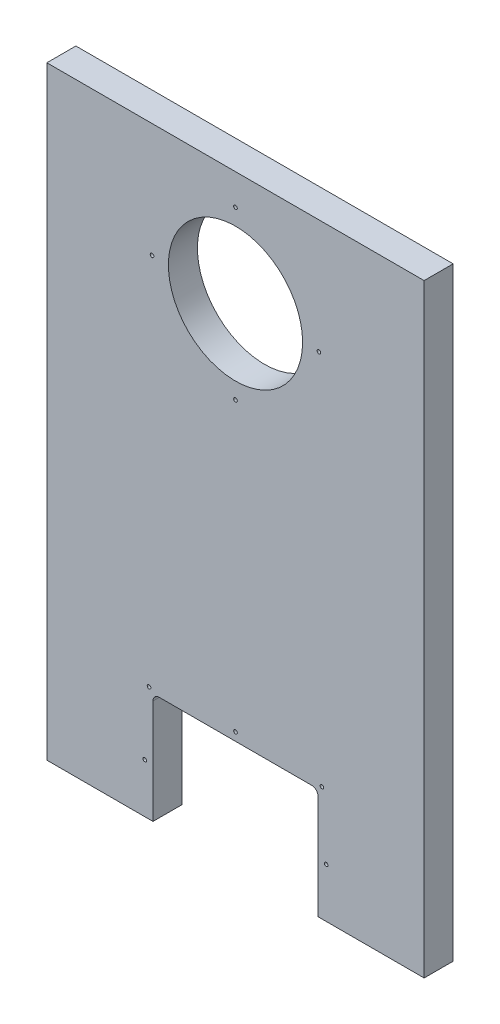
ISO-10303-21;
HEADER;
FILE_DESCRIPTION(('STEP AP214'),'2;1');
FILE_NAME('part.step','',(''),(''),'','','');
FILE_SCHEMA(('AUTOMOTIVE_DESIGN { 1 0 10303 214 1 1 1 1 }'));
ENDSEC;
DATA;
#1=APPLICATION_CONTEXT('core data for automotive mechanical design processes');
#2=APPLICATION_PROTOCOL_DEFINITION('international standard','automotive_design',2000,#1);
#3=PRODUCT_CONTEXT('',#1,'mechanical');
#4=PRODUCT('Part','Part','',(#3));
#5=PRODUCT_RELATED_PRODUCT_CATEGORY('part','',(#4));
#6=PRODUCT_DEFINITION_FORMATION('','',#4);
#7=PRODUCT_DEFINITION_CONTEXT('part definition',#1,'design');
#8=PRODUCT_DEFINITION('design','',#6,#7);
#9=PRODUCT_DEFINITION_SHAPE('','',#8);
#10=(LENGTH_UNIT() NAMED_UNIT(*) SI_UNIT(.MILLI.,.METRE.));
#11=(NAMED_UNIT(*) PLANE_ANGLE_UNIT() SI_UNIT($,.RADIAN.));
#12=(NAMED_UNIT(*) SI_UNIT($,.STERADIAN.) SOLID_ANGLE_UNIT());
#13=UNCERTAINTY_MEASURE_WITH_UNIT(LENGTH_MEASURE(1.E-05),#10,'distance_accuracy_value','');
#14=(GEOMETRIC_REPRESENTATION_CONTEXT(3) GLOBAL_UNCERTAINTY_ASSIGNED_CONTEXT((#13)) GLOBAL_UNIT_ASSIGNED_CONTEXT((#10,
#11,#12)) REPRESENTATION_CONTEXT('',''));
#15=CARTESIAN_POINT('',(0.,0.,0.));
#16=DIRECTION('',(0.,0.,1.));
#17=DIRECTION('',(1.,0.,0.));
#18=AXIS2_PLACEMENT_3D('',#15,#16,#17);
#19=CARTESIAN_POINT('',(0.,-333.,16.));
#20=DIRECTION('',(0.,1.,0.));
#21=DIRECTION('',(0.,0.,1.));
#22=AXIS2_PLACEMENT_3D('',#19,#20,#21);
#23=PLANE('',#22);
#24=DIRECTION('',(1.,0.,0.));
#25=VECTOR('',#24,1.);
#26=CARTESIAN_POINT('',(0.,-333.,0.));
#27=LINE('',#26,#25);
#28=CARTESIAN_POINT('',(0.,-333.,0.));
#29=VERTEX_POINT('',#28);
#30=CARTESIAN_POINT('',(58.5,-333.,0.));
#31=VERTEX_POINT('',#30);
#32=EDGE_CURVE('E134',#29,#31,#27,.T.);
#33=ORIENTED_EDGE('',*,*,#32,.T.);
#34=DIRECTION('',(0.,0.,1.));
#35=VECTOR('',#34,1.);
#36=CARTESIAN_POINT('',(58.5,-333.,0.));
#37=LINE('',#36,#35);
#38=CARTESIAN_POINT('',(58.5,-333.,16.));
#39=VERTEX_POINT('',#38);
#40=EDGE_CURVE('E119',#31,#39,#37,.T.);
#41=ORIENTED_EDGE('',*,*,#40,.T.);
#42=DIRECTION('',(1.,0.,0.));
#43=VECTOR('',#42,1.);
#44=CARTESIAN_POINT('',(0.,-333.,16.));
#45=LINE('',#44,#43);
#46=CARTESIAN_POINT('',(0.,-333.,16.));
#47=VERTEX_POINT('',#46);
#48=EDGE_CURVE('E85',#47,#39,#45,.T.);
#49=ORIENTED_EDGE('',*,*,#48,.F.);
#50=DIRECTION('',(0.,0.,-1.));
#51=VECTOR('',#50,1.);
#52=CARTESIAN_POINT('',(0.,-333.,16.));
#53=LINE('',#52,#51);
#54=EDGE_CURVE('E11',#47,#29,#53,.T.);
#55=ORIENTED_EDGE('',*,*,#54,.T.);
#56=EDGE_LOOP('',(#33,#41,#49,#55));
#57=FACE_BOUND('',#56,.T.);
#58=ADVANCED_FACE('F33',(#57),#23,.F.);
#59=CARTESIAN_POINT('',(0.,-333.,16.));
#60=DIRECTION('',(0.,0.,1.));
#61=DIRECTION('',(1.,0.,0.));
#62=AXIS2_PLACEMENT_3D('',#59,#60,#61);
#63=PLANE('',#62);
#64=CARTESIAN_POINT('',(154.,-305.754268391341,16.));
#65=DIRECTION('',(0.,0.,1.));
#66=DIRECTION('',(1.,0.,0.));
#67=AXIS2_PLACEMENT_3D('',#64,#65,#66);
#68=CIRCLE('',#67,0.999999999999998);
#69=CARTESIAN_POINT('',(155.,-305.754268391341,16.));
#70=VERTEX_POINT('',#69);
#71=EDGE_CURVE('E452',#70,#70,#68,.T.);
#72=ORIENTED_EDGE('',*,*,#71,.F.);
#73=EDGE_LOOP('',(#72));
#74=FACE_BOUND('',#73,.T.);
#75=CARTESIAN_POINT('',(151.656854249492,-269.843145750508,16.));
#76=DIRECTION('',(0.,0.,1.));
#77=DIRECTION('',(1.,0.,0.));
#78=AXIS2_PLACEMENT_3D('',#75,#76,#77);
#79=CIRCLE('',#78,0.999999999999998);
#80=CARTESIAN_POINT('',(152.656854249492,-269.843145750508,16.));
#81=VERTEX_POINT('',#80);
#82=EDGE_CURVE('E454',#81,#81,#79,.T.);
#83=ORIENTED_EDGE('',*,*,#82,.F.);
#84=EDGE_LOOP('',(#83));
#85=FACE_BOUND('',#84,.T.);
#86=CARTESIAN_POINT('',(104.,-267.5,16.));
#87=DIRECTION('',(0.,0.,1.));
#88=DIRECTION('',(1.,0.,0.));
#89=AXIS2_PLACEMENT_3D('',#86,#87,#88);
#90=CIRCLE('',#89,0.999999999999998);
#91=CARTESIAN_POINT('',(105.,-267.5,16.));
#92=VERTEX_POINT('',#91);
#93=EDGE_CURVE('E460',#92,#92,#90,.T.);
#94=ORIENTED_EDGE('',*,*,#93,.F.);
#95=EDGE_LOOP('',(#94));
#96=FACE_BOUND('',#95,.T.);
#97=CARTESIAN_POINT('',(56.3431457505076,-269.843145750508,16.));
#98=DIRECTION('',(0.,0.,1.));
#99=DIRECTION('',(1.,0.,0.));
#100=AXIS2_PLACEMENT_3D('',#97,#98,#99);
#101=CIRCLE('',#100,0.999999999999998);
#102=CARTESIAN_POINT('',(57.3431457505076,-269.843145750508,16.));
#103=VERTEX_POINT('',#102);
#104=EDGE_CURVE('E466',#103,#103,#101,.T.);
#105=ORIENTED_EDGE('',*,*,#104,.F.);
#106=EDGE_LOOP('',(#105));
#107=FACE_BOUND('',#106,.T.);
#108=CARTESIAN_POINT('',(54.,-305.754268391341,16.));
#109=DIRECTION('',(0.,0.,1.));
#110=DIRECTION('',(1.,0.,0.));
#111=AXIS2_PLACEMENT_3D('',#108,#109,#110);
#112=CIRCLE('',#111,0.999999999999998);
#113=CARTESIAN_POINT('',(55.,-305.754268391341,16.));
#114=VERTEX_POINT('',#113);
#115=EDGE_CURVE('E197',#114,#114,#112,.T.);
#116=ORIENTED_EDGE('',*,*,#115,.F.);
#117=EDGE_LOOP('',(#116));
#118=FACE_BOUND('',#117,.T.);
#119=DIRECTION('',(0.,-1.,0.));
#120=VECTOR('',#119,1.);
#121=CARTESIAN_POINT('',(58.5,-333.,16.));
#122=LINE('',#121,#120);
#123=CARTESIAN_POINT('',(58.5,-275.5,16.));
#124=VERTEX_POINT('',#123);
#125=EDGE_CURVE('E125',#124,#39,#122,.T.);
#126=ORIENTED_EDGE('',*,*,#125,.F.);
#127=CARTESIAN_POINT('',(62.,-275.5,16.));
#128=DIRECTION('',(0.,0.,1.));
#129=DIRECTION('',(-1.,0.,0.));
#130=AXIS2_PLACEMENT_3D('',#127,#128,#129);
#131=CIRCLE('',#130,3.5);
#132=CARTESIAN_POINT('',(62.,-272.,16.));
#133=VERTEX_POINT('',#132);
#134=EDGE_CURVE('E137',#133,#124,#131,.T.);
#135=ORIENTED_EDGE('',*,*,#134,.F.);
#136=DIRECTION('',(-1.,0.,0.));
#137=VECTOR('',#136,1.);
#138=CARTESIAN_POINT('',(62.,-272.,16.));
#139=LINE('',#138,#137);
#140=CARTESIAN_POINT('',(146.,-272.,16.));
#141=VERTEX_POINT('',#140);
#142=EDGE_CURVE('E204',#141,#133,#139,.T.);
#143=ORIENTED_EDGE('',*,*,#142,.F.);
#144=CARTESIAN_POINT('',(146.,-275.5,16.));
#145=DIRECTION('',(0.,0.,1.));
#146=DIRECTION('',(1.,0.,0.));
#147=AXIS2_PLACEMENT_3D('',#144,#145,#146);
#148=CIRCLE('',#147,3.5);
#149=CARTESIAN_POINT('',(149.5,-275.5,16.));
#150=VERTEX_POINT('',#149);
#151=EDGE_CURVE('E194',#150,#141,#148,.T.);
#152=ORIENTED_EDGE('',*,*,#151,.F.);
#153=DIRECTION('',(0.,1.,0.));
#154=VECTOR('',#153,1.);
#155=CARTESIAN_POINT('',(149.5,-333.,16.));
#156=LINE('',#155,#154);
#157=CARTESIAN_POINT('',(149.5,-333.,16.));
#158=VERTEX_POINT('',#157);
#159=EDGE_CURVE('E190',#158,#150,#156,.T.);
#160=ORIENTED_EDGE('',*,*,#159,.F.);
#161=CARTESIAN_POINT('',(208.,-333.,16.));
#162=VERTEX_POINT('',#161);
#163=EDGE_CURVE('E180',#158,#162,#45,.T.);
#164=ORIENTED_EDGE('',*,*,#163,.T.);
#165=DIRECTION('',(0.,1.,0.));
#166=VECTOR('',#165,1.);
#167=CARTESIAN_POINT('',(208.,0.,16.));
#168=LINE('',#167,#166);
#169=CARTESIAN_POINT('',(208.,0.,16.));
#170=VERTEX_POINT('',#169);
#171=EDGE_CURVE('E161',#162,#170,#168,.T.);
#172=ORIENTED_EDGE('',*,*,#171,.T.);
#173=DIRECTION('',(-1.,0.,0.));
#174=VECTOR('',#173,1.);
#175=CARTESIAN_POINT('',(0.,0.,16.));
#176=LINE('',#175,#174);
#177=CARTESIAN_POINT('',(0.,0.,16.));
#178=VERTEX_POINT('',#177);
#179=EDGE_CURVE('E57',#170,#178,#176,.T.);
#180=ORIENTED_EDGE('',*,*,#179,.T.);
#181=DIRECTION('',(0.,-1.,0.));
#182=VECTOR('',#181,1.);
#183=CARTESIAN_POINT('',(0.,0.,16.));
#184=LINE('',#183,#182);
#185=EDGE_CURVE('E150',#178,#47,#184,.T.);
#186=ORIENTED_EDGE('',*,*,#185,.T.);
#187=ORIENTED_EDGE('',*,*,#48,.T.);
#188=EDGE_LOOP('',(#126,#135,#143,#152,#160,#164,#172,#180,#186,#187));
#189=FACE_BOUND('',#188,.T.);
#190=CARTESIAN_POINT('',(150.,-63.0000000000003,16.));
#191=DIRECTION('',(0.,0.,1.));
#192=DIRECTION('',(1.,0.,0.));
#193=AXIS2_PLACEMENT_3D('',#190,#191,#192);
#194=CIRCLE('',#193,0.999999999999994);
#195=CARTESIAN_POINT('',(151.,-63.0000000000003,16.));
#196=VERTEX_POINT('',#195);
#197=EDGE_CURVE('E224',#196,#196,#194,.T.);
#198=ORIENTED_EDGE('',*,*,#197,.F.);
#199=EDGE_LOOP('',(#198));
#200=FACE_BOUND('',#199,.T.);
#201=CARTESIAN_POINT('',(58.,-63.,16.));
#202=DIRECTION('',(0.,0.,1.));
#203=DIRECTION('',(1.,0.,0.));
#204=AXIS2_PLACEMENT_3D('',#201,#202,#203);
#205=CIRCLE('',#204,0.999999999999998);
#206=CARTESIAN_POINT('',(59.,-63.,16.));
#207=VERTEX_POINT('',#206);
#208=EDGE_CURVE('E173',#207,#207,#205,.T.);
#209=ORIENTED_EDGE('',*,*,#208,.F.);
#210=EDGE_LOOP('',(#209));
#211=FACE_BOUND('',#210,.T.);
#212=CARTESIAN_POINT('',(104.,-63.,16.));
#213=DIRECTION('',(0.,0.,1.));
#214=DIRECTION('',(1.,0.,0.));
#215=AXIS2_PLACEMENT_3D('',#212,#213,#214);
#216=CIRCLE('',#215,37.);
#217=CARTESIAN_POINT('',(141.,-63.,16.));
#218=VERTEX_POINT('',#217);
#219=EDGE_CURVE('E166',#218,#218,#216,.T.);
#220=ORIENTED_EDGE('',*,*,#219,.F.);
#221=EDGE_LOOP('',(#220));
#222=FACE_BOUND('',#221,.T.);
#223=CARTESIAN_POINT('',(104.,-17.,16.));
#224=DIRECTION('',(0.,0.,1.));
#225=DIRECTION('',(1.,0.,0.));
#226=AXIS2_PLACEMENT_3D('',#223,#224,#225);
#227=CIRCLE('',#226,0.999999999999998);
#228=CARTESIAN_POINT('',(105.,-17.,16.));
#229=VERTEX_POINT('',#228);
#230=EDGE_CURVE('E230',#229,#229,#227,.T.);
#231=ORIENTED_EDGE('',*,*,#230,.F.);
#232=EDGE_LOOP('',(#231));
#233=FACE_BOUND('',#232,.T.);
#234=CARTESIAN_POINT('',(104.,-109.,16.));
#235=DIRECTION('',(0.,0.,1.));
#236=DIRECTION('',(1.,0.,0.));
#237=AXIS2_PLACEMENT_3D('',#234,#235,#236);
#238=CIRCLE('',#237,0.999999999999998);
#239=CARTESIAN_POINT('',(105.,-109.,16.));
#240=VERTEX_POINT('',#239);
#241=EDGE_CURVE('E218',#240,#240,#238,.T.);
#242=ORIENTED_EDGE('',*,*,#241,.F.);
#243=EDGE_LOOP('',(#242));
#244=FACE_BOUND('',#243,.T.);
#245=ADVANCED_FACE('F182',(#74,#85,#96,#107,#118,#189,#200,#211,#222,#233,#244),#63,.T.);
#246=CARTESIAN_POINT('',(0.,-333.,0.));
#247=DIRECTION('',(0.,0.,1.));
#248=DIRECTION('',(1.,0.,0.));
#249=AXIS2_PLACEMENT_3D('',#246,#247,#248);
#250=PLANE('',#249);
#251=CARTESIAN_POINT('',(154.,-305.754268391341,0.));
#252=DIRECTION('',(0.,0.,1.));
#253=DIRECTION('',(1.,0.,0.));
#254=AXIS2_PLACEMENT_3D('',#251,#252,#253);
#255=CIRCLE('',#254,0.999999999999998);
#256=CARTESIAN_POINT('',(155.,-305.754268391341,0.));
#257=VERTEX_POINT('',#256);
#258=EDGE_CURVE('E449',#257,#257,#255,.T.);
#259=ORIENTED_EDGE('',*,*,#258,.T.);
#260=EDGE_LOOP('',(#259));
#261=FACE_BOUND('',#260,.T.);
#262=CARTESIAN_POINT('',(151.656854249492,-269.843145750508,0.));
#263=DIRECTION('',(0.,0.,1.));
#264=DIRECTION('',(1.,0.,0.));
#265=AXIS2_PLACEMENT_3D('',#262,#263,#264);
#266=CIRCLE('',#265,0.999999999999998);
#267=CARTESIAN_POINT('',(152.656854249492,-269.843145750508,0.));
#268=VERTEX_POINT('',#267);
#269=EDGE_CURVE('E457',#268,#268,#266,.T.);
#270=ORIENTED_EDGE('',*,*,#269,.T.);
#271=EDGE_LOOP('',(#270));
#272=FACE_BOUND('',#271,.T.);
#273=CARTESIAN_POINT('',(104.,-267.5,0.));
#274=DIRECTION('',(0.,0.,1.));
#275=DIRECTION('',(1.,0.,0.));
#276=AXIS2_PLACEMENT_3D('',#273,#274,#275);
#277=CIRCLE('',#276,0.999999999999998);
#278=CARTESIAN_POINT('',(105.,-267.5,0.));
#279=VERTEX_POINT('',#278);
#280=EDGE_CURVE('E463',#279,#279,#277,.T.);
#281=ORIENTED_EDGE('',*,*,#280,.T.);
#282=EDGE_LOOP('',(#281));
#283=FACE_BOUND('',#282,.T.);
#284=CARTESIAN_POINT('',(56.3431457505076,-269.843145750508,0.));
#285=DIRECTION('',(0.,0.,1.));
#286=DIRECTION('',(1.,0.,0.));
#287=AXIS2_PLACEMENT_3D('',#284,#285,#286);
#288=CIRCLE('',#287,0.999999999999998);
#289=CARTESIAN_POINT('',(57.3431457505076,-269.843145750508,0.));
#290=VERTEX_POINT('',#289);
#291=EDGE_CURVE('E469',#290,#290,#288,.T.);
#292=ORIENTED_EDGE('',*,*,#291,.T.);
#293=EDGE_LOOP('',(#292));
#294=FACE_BOUND('',#293,.T.);
#295=CARTESIAN_POINT('',(54.,-305.754268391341,0.));
#296=DIRECTION('',(0.,0.,1.));
#297=DIRECTION('',(1.,0.,0.));
#298=AXIS2_PLACEMENT_3D('',#295,#296,#297);
#299=CIRCLE('',#298,0.999999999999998);
#300=CARTESIAN_POINT('',(55.,-305.754268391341,0.));
#301=VERTEX_POINT('',#300);
#302=EDGE_CURVE('E191',#301,#301,#299,.T.);
#303=ORIENTED_EDGE('',*,*,#302,.T.);
#304=EDGE_LOOP('',(#303));
#305=FACE_BOUND('',#304,.T.);
#306=CARTESIAN_POINT('',(150.,-63.0000000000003,0.));
#307=DIRECTION('',(0.,0.,1.));
#308=DIRECTION('',(1.,0.,0.));
#309=AXIS2_PLACEMENT_3D('',#306,#307,#308);
#310=CIRCLE('',#309,0.999999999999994);
#311=CARTESIAN_POINT('',(151.,-63.0000000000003,0.));
#312=VERTEX_POINT('',#311);
#313=EDGE_CURVE('E221',#312,#312,#310,.T.);
#314=ORIENTED_EDGE('',*,*,#313,.T.);
#315=EDGE_LOOP('',(#314));
#316=FACE_BOUND('',#315,.T.);
#317=CARTESIAN_POINT('',(58.,-63.,0.));
#318=DIRECTION('',(0.,0.,1.));
#319=DIRECTION('',(1.,0.,0.));
#320=AXIS2_PLACEMENT_3D('',#317,#318,#319);
#321=CIRCLE('',#320,0.999999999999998);
#322=CARTESIAN_POINT('',(59.,-63.,0.));
#323=VERTEX_POINT('',#322);
#324=EDGE_CURVE('E176',#323,#323,#321,.T.);
#325=ORIENTED_EDGE('',*,*,#324,.T.);
#326=EDGE_LOOP('',(#325));
#327=FACE_BOUND('',#326,.T.);
#328=CARTESIAN_POINT('',(62.,-275.5,0.));
#329=DIRECTION('',(0.,0.,1.));
#330=DIRECTION('',(-1.,0.,0.));
#331=AXIS2_PLACEMENT_3D('',#328,#329,#330);
#332=CIRCLE('',#331,3.5);
#333=CARTESIAN_POINT('',(62.,-272.,0.));
#334=VERTEX_POINT('',#333);
#335=CARTESIAN_POINT('',(58.5,-275.5,0.));
#336=VERTEX_POINT('',#335);
#337=EDGE_CURVE('E128',#334,#336,#332,.T.);
#338=ORIENTED_EDGE('',*,*,#337,.T.);
#339=DIRECTION('',(0.,-1.,0.));
#340=VECTOR('',#339,1.);
#341=CARTESIAN_POINT('',(58.5,-333.,0.));
#342=LINE('',#341,#340);
#343=EDGE_CURVE('E122',#336,#31,#342,.T.);
#344=ORIENTED_EDGE('',*,*,#343,.T.);
#345=ORIENTED_EDGE('',*,*,#32,.F.);
#346=DIRECTION('',(0.,-1.,0.));
#347=VECTOR('',#346,1.);
#348=CARTESIAN_POINT('',(0.,0.,0.));
#349=LINE('',#348,#347);
#350=CARTESIAN_POINT('',(0.,0.,0.));
#351=VERTEX_POINT('',#350);
#352=EDGE_CURVE('E145',#351,#29,#349,.T.);
#353=ORIENTED_EDGE('',*,*,#352,.F.);
#354=DIRECTION('',(-1.,0.,0.));
#355=VECTOR('',#354,1.);
#356=CARTESIAN_POINT('',(0.,0.,0.));
#357=LINE('',#356,#355);
#358=CARTESIAN_POINT('',(208.,0.,0.));
#359=VERTEX_POINT('',#358);
#360=EDGE_CURVE('E78',#359,#351,#357,.T.);
#361=ORIENTED_EDGE('',*,*,#360,.F.);
#362=DIRECTION('',(0.,1.,0.));
#363=VECTOR('',#362,1.);
#364=CARTESIAN_POINT('',(208.,0.,0.));
#365=LINE('',#364,#363);
#366=CARTESIAN_POINT('',(208.,-333.,0.));
#367=VERTEX_POINT('',#366);
#368=EDGE_CURVE('E141',#367,#359,#365,.T.);
#369=ORIENTED_EDGE('',*,*,#368,.F.);
#370=CARTESIAN_POINT('',(149.5,-333.,0.));
#371=VERTEX_POINT('',#370);
#372=EDGE_CURVE('E142',#371,#367,#27,.T.);
#373=ORIENTED_EDGE('',*,*,#372,.F.);
#374=DIRECTION('',(0.,1.,0.));
#375=VECTOR('',#374,1.);
#376=CARTESIAN_POINT('',(149.5,-333.,0.));
#377=LINE('',#376,#375);
#378=CARTESIAN_POINT('',(149.5,-275.5,0.));
#379=VERTEX_POINT('',#378);
#380=EDGE_CURVE('E48',#371,#379,#377,.T.);
#381=ORIENTED_EDGE('',*,*,#380,.T.);
#382=CARTESIAN_POINT('',(146.,-275.5,0.));
#383=DIRECTION('',(0.,0.,1.));
#384=DIRECTION('',(1.,0.,0.));
#385=AXIS2_PLACEMENT_3D('',#382,#383,#384);
#386=CIRCLE('',#385,3.5);
#387=CARTESIAN_POINT('',(146.,-272.,0.));
#388=VERTEX_POINT('',#387);
#389=EDGE_CURVE('E274',#379,#388,#386,.T.);
#390=ORIENTED_EDGE('',*,*,#389,.T.);
#391=DIRECTION('',(-1.,0.,0.));
#392=VECTOR('',#391,1.);
#393=CARTESIAN_POINT('',(62.,-272.,0.));
#394=LINE('',#393,#392);
#395=EDGE_CURVE('E275',#388,#334,#394,.T.);
#396=ORIENTED_EDGE('',*,*,#395,.T.);
#397=EDGE_LOOP('',(#338,#344,#345,#353,#361,#369,#373,#381,#390,#396));
#398=FACE_BOUND('',#397,.T.);
#399=CARTESIAN_POINT('',(104.,-63.,0.));
#400=DIRECTION('',(0.,0.,1.));
#401=DIRECTION('',(1.,0.,0.));
#402=AXIS2_PLACEMENT_3D('',#399,#400,#401);
#403=CIRCLE('',#402,37.);
#404=CARTESIAN_POINT('',(141.,-63.,0.));
#405=VERTEX_POINT('',#404);
#406=EDGE_CURVE('E168',#405,#405,#403,.T.);
#407=ORIENTED_EDGE('',*,*,#406,.T.);
#408=EDGE_LOOP('',(#407));
#409=FACE_BOUND('',#408,.T.);
#410=CARTESIAN_POINT('',(104.,-17.,0.));
#411=DIRECTION('',(0.,0.,1.));
#412=DIRECTION('',(1.,0.,0.));
#413=AXIS2_PLACEMENT_3D('',#410,#411,#412);
#414=CIRCLE('',#413,0.999999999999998);
#415=CARTESIAN_POINT('',(105.,-17.,0.));
#416=VERTEX_POINT('',#415);
#417=EDGE_CURVE('E227',#416,#416,#414,.T.);
#418=ORIENTED_EDGE('',*,*,#417,.T.);
#419=EDGE_LOOP('',(#418));
#420=FACE_BOUND('',#419,.T.);
#421=CARTESIAN_POINT('',(104.,-109.,0.));
#422=DIRECTION('',(0.,0.,1.));
#423=DIRECTION('',(1.,0.,0.));
#424=AXIS2_PLACEMENT_3D('',#421,#422,#423);
#425=CIRCLE('',#424,0.999999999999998);
#426=CARTESIAN_POINT('',(105.,-109.,0.));
#427=VERTEX_POINT('',#426);
#428=EDGE_CURVE('E210',#427,#427,#425,.T.);
#429=ORIENTED_EDGE('',*,*,#428,.T.);
#430=EDGE_LOOP('',(#429));
#431=FACE_BOUND('',#430,.T.);
#432=ADVANCED_FACE('F131',(#261,#272,#283,#294,#305,#316,#327,#398,#409,#420,#431),#250,.F.);
#433=CARTESIAN_POINT('',(0.,0.,16.));
#434=DIRECTION('',(1.,0.,0.));
#435=DIRECTION('',(0.,1.,0.));
#436=AXIS2_PLACEMENT_3D('',#433,#434,#435);
#437=PLANE('',#436);
#438=ORIENTED_EDGE('',*,*,#352,.T.);
#439=ORIENTED_EDGE('',*,*,#54,.F.);
#440=ORIENTED_EDGE('',*,*,#185,.F.);
#441=DIRECTION('',(0.,0.,-1.));
#442=VECTOR('',#441,1.);
#443=CARTESIAN_POINT('',(0.,0.,16.));
#444=LINE('',#443,#442);
#445=EDGE_CURVE('E151',#178,#351,#444,.T.);
#446=ORIENTED_EDGE('',*,*,#445,.T.);
#447=EDGE_LOOP('',(#438,#439,#440,#446));
#448=FACE_BOUND('',#447,.T.);
#449=ADVANCED_FACE('F35',(#448),#437,.F.);
#450=ORIENTED_EDGE('',*,*,#163,.F.);
#451=DIRECTION('',(0.,0.,1.));
#452=VECTOR('',#451,1.);
#453=CARTESIAN_POINT('',(149.5,-333.,0.));
#454=LINE('',#453,#452);
#455=EDGE_CURVE('E127',#371,#158,#454,.T.);
#456=ORIENTED_EDGE('',*,*,#455,.F.);
#457=ORIENTED_EDGE('',*,*,#372,.T.);
#458=DIRECTION('',(0.,0.,-1.));
#459=VECTOR('',#458,1.);
#460=CARTESIAN_POINT('',(208.,-333.,16.));
#461=LINE('',#460,#459);
#462=EDGE_CURVE('E41',#162,#367,#461,.T.);
#463=ORIENTED_EDGE('',*,*,#462,.F.);
#464=EDGE_LOOP('',(#450,#456,#457,#463));
#465=FACE_BOUND('',#464,.T.);
#466=ADVANCED_FACE('F255',(#465),#23,.F.);
#467=CARTESIAN_POINT('',(208.,0.,16.));
#468=DIRECTION('',(-1.,0.,0.));
#469=DIRECTION('',(0.,-1.,0.));
#470=AXIS2_PLACEMENT_3D('',#467,#468,#469);
#471=PLANE('',#470);
#472=ORIENTED_EDGE('',*,*,#368,.T.);
#473=DIRECTION('',(0.,0.,-1.));
#474=VECTOR('',#473,1.);
#475=CARTESIAN_POINT('',(208.,0.,16.));
#476=LINE('',#475,#474);
#477=EDGE_CURVE('E153',#170,#359,#476,.T.);
#478=ORIENTED_EDGE('',*,*,#477,.F.);
#479=ORIENTED_EDGE('',*,*,#171,.F.);
#480=ORIENTED_EDGE('',*,*,#462,.T.);
#481=EDGE_LOOP('',(#472,#478,#479,#480));
#482=FACE_BOUND('',#481,.T.);
#483=ADVANCED_FACE('F159',(#482),#471,.F.);
#484=CARTESIAN_POINT('',(0.,0.,16.));
#485=DIRECTION('',(0.,-1.,0.));
#486=DIRECTION('',(0.,0.,-1.));
#487=AXIS2_PLACEMENT_3D('',#484,#485,#486);
#488=PLANE('',#487);
#489=ORIENTED_EDGE('',*,*,#360,.T.);
#490=ORIENTED_EDGE('',*,*,#445,.F.);
#491=ORIENTED_EDGE('',*,*,#179,.F.);
#492=ORIENTED_EDGE('',*,*,#477,.T.);
#493=EDGE_LOOP('',(#489,#490,#491,#492));
#494=FACE_BOUND('',#493,.T.);
#495=ADVANCED_FACE('F185',(#494),#488,.F.);
#496=CARTESIAN_POINT('',(104.,-63.,16.));
#497=DIRECTION('',(0.,0.,-1.));
#498=DIRECTION('',(-1.,0.,0.));
#499=AXIS2_PLACEMENT_3D('',#496,#497,#498);
#500=CYLINDRICAL_SURFACE('',#499,37.);
#501=ORIENTED_EDGE('',*,*,#219,.T.);
#502=EDGE_LOOP('',(#501));
#503=FACE_BOUND('',#502,.T.);
#504=ORIENTED_EDGE('',*,*,#406,.F.);
#505=EDGE_LOOP('',(#504));
#506=FACE_BOUND('',#505,.T.);
#507=ADVANCED_FACE('F244',(#503,#506),#500,.F.);
#508=CARTESIAN_POINT('',(58.,-63.,16.));
#509=DIRECTION('',(0.,0.,-1.));
#510=DIRECTION('',(-1.,0.,0.));
#511=AXIS2_PLACEMENT_3D('',#508,#509,#510);
#512=CYLINDRICAL_SURFACE('',#511,0.999999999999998);
#513=ORIENTED_EDGE('',*,*,#208,.T.);
#514=EDGE_LOOP('',(#513));
#515=FACE_BOUND('',#514,.T.);
#516=ORIENTED_EDGE('',*,*,#324,.F.);
#517=EDGE_LOOP('',(#516));
#518=FACE_BOUND('',#517,.T.);
#519=ADVANCED_FACE('F241',(#515,#518),#512,.F.);
#520=CARTESIAN_POINT('',(104.,-17.,16.));
#521=DIRECTION('',(0.,0.,-1.));
#522=DIRECTION('',(-1.,0.,0.));
#523=AXIS2_PLACEMENT_3D('',#520,#521,#522);
#524=CYLINDRICAL_SURFACE('',#523,0.999999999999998);
#525=ORIENTED_EDGE('',*,*,#230,.T.);
#526=EDGE_LOOP('',(#525));
#527=FACE_BOUND('',#526,.T.);
#528=ORIENTED_EDGE('',*,*,#417,.F.);
#529=EDGE_LOOP('',(#528));
#530=FACE_BOUND('',#529,.T.);
#531=ADVANCED_FACE('F243',(#527,#530),#524,.F.);
#532=CARTESIAN_POINT('',(150.,-63.0000000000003,16.));
#533=DIRECTION('',(0.,0.,-1.));
#534=DIRECTION('',(-1.,0.,0.));
#535=AXIS2_PLACEMENT_3D('',#532,#533,#534);
#536=CYLINDRICAL_SURFACE('',#535,0.999999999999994);
#537=ORIENTED_EDGE('',*,*,#197,.T.);
#538=EDGE_LOOP('',(#537));
#539=FACE_BOUND('',#538,.T.);
#540=ORIENTED_EDGE('',*,*,#313,.F.);
#541=EDGE_LOOP('',(#540));
#542=FACE_BOUND('',#541,.T.);
#543=ADVANCED_FACE('F250',(#539,#542),#536,.F.);
#544=CARTESIAN_POINT('',(104.,-109.,16.));
#545=DIRECTION('',(0.,0.,-1.));
#546=DIRECTION('',(-1.,0.,0.));
#547=AXIS2_PLACEMENT_3D('',#544,#545,#546);
#548=CYLINDRICAL_SURFACE('',#547,0.999999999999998);
#549=ORIENTED_EDGE('',*,*,#241,.T.);
#550=EDGE_LOOP('',(#549));
#551=FACE_BOUND('',#550,.T.);
#552=ORIENTED_EDGE('',*,*,#428,.F.);
#553=EDGE_LOOP('',(#552));
#554=FACE_BOUND('',#553,.T.);
#555=ADVANCED_FACE('F290',(#551,#554),#548,.F.);
#556=CARTESIAN_POINT('',(58.5,-333.,0.));
#557=DIRECTION('',(-1.,0.,0.));
#558=DIRECTION('',(0.,0.,1.));
#559=AXIS2_PLACEMENT_3D('',#556,#557,#558);
#560=PLANE('',#559);
#561=ORIENTED_EDGE('',*,*,#125,.T.);
#562=ORIENTED_EDGE('',*,*,#40,.F.);
#563=ORIENTED_EDGE('',*,*,#343,.F.);
#564=DIRECTION('',(0.,0.,1.));
#565=VECTOR('',#564,1.);
#566=CARTESIAN_POINT('',(58.5,-275.5,0.));
#567=LINE('',#566,#565);
#568=EDGE_CURVE('E208',#336,#124,#567,.T.);
#569=ORIENTED_EDGE('',*,*,#568,.T.);
#570=EDGE_LOOP('',(#561,#562,#563,#569));
#571=FACE_BOUND('',#570,.T.);
#572=ADVANCED_FACE('F121',(#571),#560,.F.);
#573=CARTESIAN_POINT('',(62.,-275.5,0.));
#574=DIRECTION('',(0.,0.,1.));
#575=DIRECTION('',(1.,0.,0.));
#576=AXIS2_PLACEMENT_3D('',#573,#574,#575);
#577=CYLINDRICAL_SURFACE('',#576,3.5);
#578=ORIENTED_EDGE('',*,*,#134,.T.);
#579=ORIENTED_EDGE('',*,*,#568,.F.);
#580=ORIENTED_EDGE('',*,*,#337,.F.);
#581=DIRECTION('',(0.,0.,1.));
#582=VECTOR('',#581,1.);
#583=CARTESIAN_POINT('',(62.,-272.,0.));
#584=LINE('',#583,#582);
#585=EDGE_CURVE('E211',#334,#133,#584,.T.);
#586=ORIENTED_EDGE('',*,*,#585,.T.);
#587=EDGE_LOOP('',(#578,#579,#580,#586));
#588=FACE_BOUND('',#587,.T.);
#589=ADVANCED_FACE('F282',(#588),#577,.F.);
#590=CARTESIAN_POINT('',(62.,-272.,0.));
#591=DIRECTION('',(0.,1.,0.));
#592=DIRECTION('',(0.,0.,1.));
#593=AXIS2_PLACEMENT_3D('',#590,#591,#592);
#594=PLANE('',#593);
#595=ORIENTED_EDGE('',*,*,#142,.T.);
#596=ORIENTED_EDGE('',*,*,#585,.F.);
#597=ORIENTED_EDGE('',*,*,#395,.F.);
#598=DIRECTION('',(0.,0.,1.));
#599=VECTOR('',#598,1.);
#600=CARTESIAN_POINT('',(146.,-272.,0.));
#601=LINE('',#600,#599);
#602=EDGE_CURVE('E213',#388,#141,#601,.T.);
#603=ORIENTED_EDGE('',*,*,#602,.T.);
#604=EDGE_LOOP('',(#595,#596,#597,#603));
#605=FACE_BOUND('',#604,.T.);
#606=ADVANCED_FACE('F280',(#605),#594,.F.);
#607=CARTESIAN_POINT('',(146.,-275.5,0.));
#608=DIRECTION('',(0.,0.,1.));
#609=DIRECTION('',(1.,0.,0.));
#610=AXIS2_PLACEMENT_3D('',#607,#608,#609);
#611=CYLINDRICAL_SURFACE('',#610,3.5);
#612=ORIENTED_EDGE('',*,*,#151,.T.);
#613=ORIENTED_EDGE('',*,*,#602,.F.);
#614=ORIENTED_EDGE('',*,*,#389,.F.);
#615=DIRECTION('',(0.,0.,1.));
#616=VECTOR('',#615,1.);
#617=CARTESIAN_POINT('',(149.5,-275.5,0.));
#618=LINE('',#617,#616);
#619=EDGE_CURVE('E215',#379,#150,#618,.T.);
#620=ORIENTED_EDGE('',*,*,#619,.T.);
#621=EDGE_LOOP('',(#612,#613,#614,#620));
#622=FACE_BOUND('',#621,.T.);
#623=ADVANCED_FACE('F270',(#622),#611,.F.);
#624=CARTESIAN_POINT('',(149.5,-333.,0.));
#625=DIRECTION('',(1.,0.,0.));
#626=DIRECTION('',(0.,0.,-1.));
#627=AXIS2_PLACEMENT_3D('',#624,#625,#626);
#628=PLANE('',#627);
#629=ORIENTED_EDGE('',*,*,#159,.T.);
#630=ORIENTED_EDGE('',*,*,#619,.F.);
#631=ORIENTED_EDGE('',*,*,#380,.F.);
#632=ORIENTED_EDGE('',*,*,#455,.T.);
#633=EDGE_LOOP('',(#629,#630,#631,#632));
#634=FACE_BOUND('',#633,.T.);
#635=ADVANCED_FACE('F267',(#634),#628,.F.);
#636=CARTESIAN_POINT('',(54.,-305.754268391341,0.));
#637=DIRECTION('',(0.,0.,1.));
#638=DIRECTION('',(1.,0.,0.));
#639=AXIS2_PLACEMENT_3D('',#636,#637,#638);
#640=CYLINDRICAL_SURFACE('',#639,0.999999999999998);
#641=ORIENTED_EDGE('',*,*,#302,.F.);
#642=EDGE_LOOP('',(#641));
#643=FACE_BOUND('',#642,.T.);
#644=ORIENTED_EDGE('',*,*,#115,.T.);
#645=EDGE_LOOP('',(#644));
#646=FACE_BOUND('',#645,.T.);
#647=ADVANCED_FACE('F293',(#643,#646),#640,.F.);
#648=CARTESIAN_POINT('',(56.3431457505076,-269.843145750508,0.));
#649=DIRECTION('',(0.,0.,1.));
#650=DIRECTION('',(1.,0.,0.));
#651=AXIS2_PLACEMENT_3D('',#648,#649,#650);
#652=CYLINDRICAL_SURFACE('',#651,0.999999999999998);
#653=ORIENTED_EDGE('',*,*,#291,.F.);
#654=EDGE_LOOP('',(#653));
#655=FACE_BOUND('',#654,.T.);
#656=ORIENTED_EDGE('',*,*,#104,.T.);
#657=EDGE_LOOP('',(#656));
#658=FACE_BOUND('',#657,.T.);
#659=ADVANCED_FACE('F405',(#655,#658),#652,.F.);
#660=CARTESIAN_POINT('',(104.,-267.5,0.));
#661=DIRECTION('',(0.,0.,1.));
#662=DIRECTION('',(1.,0.,0.));
#663=AXIS2_PLACEMENT_3D('',#660,#661,#662);
#664=CYLINDRICAL_SURFACE('',#663,0.999999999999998);
#665=ORIENTED_EDGE('',*,*,#280,.F.);
#666=EDGE_LOOP('',(#665));
#667=FACE_BOUND('',#666,.T.);
#668=ORIENTED_EDGE('',*,*,#93,.T.);
#669=EDGE_LOOP('',(#668));
#670=FACE_BOUND('',#669,.T.);
#671=ADVANCED_FACE('F414',(#667,#670),#664,.F.);
#672=CARTESIAN_POINT('',(151.656854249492,-269.843145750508,0.));
#673=DIRECTION('',(0.,0.,1.));
#674=DIRECTION('',(1.,0.,0.));
#675=AXIS2_PLACEMENT_3D('',#672,#673,#674);
#676=CYLINDRICAL_SURFACE('',#675,0.999999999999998);
#677=ORIENTED_EDGE('',*,*,#269,.F.);
#678=EDGE_LOOP('',(#677));
#679=FACE_BOUND('',#678,.T.);
#680=ORIENTED_EDGE('',*,*,#82,.T.);
#681=EDGE_LOOP('',(#680));
#682=FACE_BOUND('',#681,.T.);
#683=ADVANCED_FACE('F423',(#679,#682),#676,.F.);
#684=CARTESIAN_POINT('',(154.,-305.754268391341,0.));
#685=DIRECTION('',(0.,0.,1.));
#686=DIRECTION('',(1.,0.,0.));
#687=AXIS2_PLACEMENT_3D('',#684,#685,#686);
#688=CYLINDRICAL_SURFACE('',#687,0.999999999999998);
#689=ORIENTED_EDGE('',*,*,#258,.F.);
#690=EDGE_LOOP('',(#689));
#691=FACE_BOUND('',#690,.T.);
#692=ORIENTED_EDGE('',*,*,#71,.T.);
#693=EDGE_LOOP('',(#692));
#694=FACE_BOUND('',#693,.T.);
#695=ADVANCED_FACE('F433',(#691,#694),#688,.F.);
#696=CLOSED_SHELL('',(#58,#245,#432,#449,#466,#483,#495,#507,#519,#531,#543,#555,#572,#589,#606,
#623,#635,#647,#659,#671,#683,#695));
#697=MANIFOLD_SOLID_BREP('B2',#696);
#698=ADVANCED_BREP_SHAPE_REPRESENTATION('',(#18,#697),#14);
#699=SHAPE_DEFINITION_REPRESENTATION(#9,#698);
ENDSEC;
END-ISO-10303-21;
